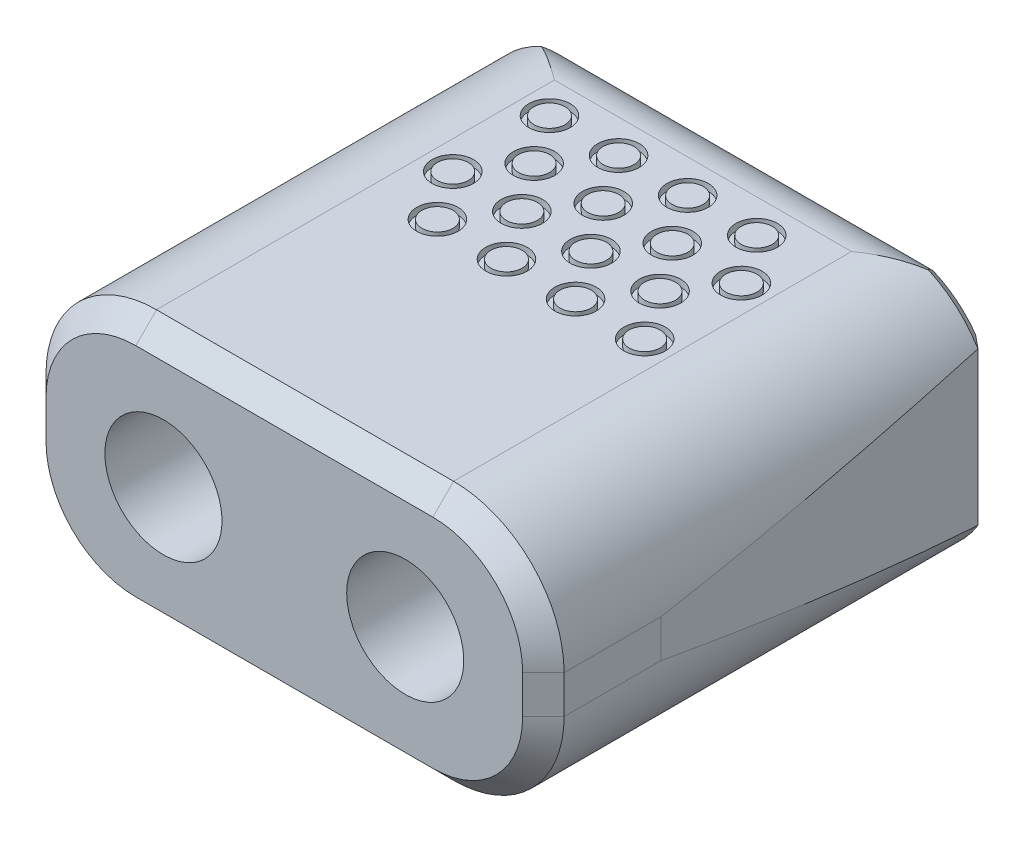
from build123d import *

# Parameters (mm, degrees)
SKETCH3_W             = 16.9672
SKETCH3_H             = 9.525
EXTRUDE1_DEPTH        = 19.05
F_6_CBORE_D           = 4.3053
F_6_CBORE_CBORE_D     = 6.604
F_6_CBORE_CBORE_DEPTH = 4.064
FILLET1_R             = 4.064
CHAMFER1_SIZE         = 0.396875
CHAMFER2_SIZE         = 0.762
CUT_EXTRUDE2_DEPTH    = 26.951296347
CUT_EXTRUDE1_DEPTH    = 12.5
CHAMFER3_SIZE         = 0.396875
CHAMFER3_SIZE2        = 0.443224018
SKETCH10_R            = 0.762
SKETCH10_R_2          = 0.5715
CUT_EXTRUDE3_DEPTH    = 0.254


with BuildPart() as part:
    # Sketch3 → Extrude1 (new body)
    with BuildSketch(Plane(origin=(0, 0, 0), x_dir=(0, 0, -1), z_dir=(1, 0, 0))):
        with Locations((8.4836, 0)):
            Rectangle(SKETCH3_W, SKETCH3_H)
    extrude(amount=EXTRUDE1_DEPTH)

    # 6 CBORE (through all)
    with Locations(Plane(origin=(0, 0, -16.9672), x_dir=(-1, 0, 0), z_dir=(0, 0, -1))):
        with Locations((-5.08, 0), (-13.97, 0)):
            CounterBoreHole(F_6_CBORE_D / 2, F_6_CBORE_CBORE_D / 2, F_6_CBORE_CBORE_DEPTH)

    # Fillet1
    fillet1_edges = [part.edges().sort_by_distance(p)[0] for p in [
        (19.05, 4.7625, -8.4836),
        (0, 4.7625, -8.4836),
        (0, -4.7625, -8.4836),
        (19.05, -4.7625, -8.4836),
    ]]
    fillet(fillet1_edges, radius=FILLET1_R)

    # Chamfer1
    chamfer1_edges = [part.edges().sort_by_distance(p)[0] for p in [
        (9.525, 4.7625, -16.9672),
        (0, 0, -16.9672),
        (19.05, 0, -16.9672),
        (9.525, -4.7625, -16.9672),
        (17.859681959, 3.572181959, -16.9672),
        (17.859681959, -3.572181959, -16.9672),
        (1.190318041, -3.572181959, -16.9672),
        (1.190318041, 3.572181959, -16.9672),
    ]]
    chamfer(chamfer1_edges, length=CHAMFER1_SIZE)

    # Chamfer2
    chamfer2_edges = [part.edges().sort_by_distance(p)[0] for p in [
        (9.525, 4.7625, 0),
        (0, 0, 0),
        (9.525, -4.7625, 0),
        (19.05, 0, 0),
        (17.859681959, 3.572181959, 0),
        (17.859681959, -3.572181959, 0),
        (1.190318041, -3.572181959, 0),
        (1.190318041, 3.572181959, 0),
    ]]
    chamfer(chamfer2_edges, length=CHAMFER2_SIZE)

    # Sketch8 → Cut-Extrude2 (cut, through all)
    with BuildSketch(Plane.ZY):
        with BuildLine():
            Line((-15.3924, -4.7625), (-15.3924, -7.3025))
            Line((-15.3924, -7.3025), (-21.7424, -7.3025))
            Line((-21.7424, -7.3025), (-21.7424, -0.9525))
            Line((-21.7424, -0.9525), (-19.2024, -0.9525))
            ThreePointArc((-19.2024, -0.9525), (-18.770316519, -2.714822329), (-17.572069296, -4.077422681))
            Line((-17.572069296, -4.077422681), (-16.9672, -4.077422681))
            ThreePointArc((-16.9672, -4.077422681), (-16.251080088, -4.583814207), (-15.3924, -4.7625))
        make_face()
        with BuildLine():
            Line((-16.9672, 4.077422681), (-17.572069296, 4.077422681))
            ThreePointArc((-17.572069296, 4.077422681), (-18.770316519, 2.714822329), (-19.2024, 0.9525))
            Line((-19.2024, 0.9525), (-21.7424, 0.9525))
            Line((-21.7424, 0.9525), (-21.7424, 7.3025))
            Line((-21.7424, 7.3025), (-15.3924, 7.3025))
            Line((-15.3924, 7.3025), (-15.3924, 4.7625))
            ThreePointArc((-15.3924, 4.7625), (-16.251080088, 4.583814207), (-16.9672, 4.077422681))
        make_face()
    extrude(amount=-CUT_EXTRUDE2_DEPTH, mode=Mode.SUBTRACT)

    # Sketch5 → Cut-Extrude1 (cut, symmetric)
    with BuildSketch(Plane(origin=(0, 0, 0), x_dir=(1, 0, 0), z_dir=(0, 1, 0))):
        with BuildLine():
            Line((19.05, 4.318), (31.75, 4.318))
            Line((31.75, 4.318), (31.75, 29.718))
            Line((31.75, 29.718), (16.484078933, 29.718))
            ThreePointArc((16.484078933, 29.718), (18.406891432, 17.082638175), (19.05, 4.318))
        make_face()
    cut_extrude1 = extrude(amount=CUT_EXTRUDE1_DEPTH, both=True, mode=Mode.SUBTRACT)

    # Mirror2: Cut-Extrude1 across plane
    add(cut_extrude1.mirror(Plane(origin=(9.525, 0, 0), x_dir=(0, 0, 1), z_dir=(1, 0, 0))), mode=Mode.SUBTRACT)

    # Chamfer3
    chamfer3_edges = [part.edges().sort_by_distance(p)[0] for p in [
        (18.418499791, 0, -16.9672),
    ]]
    chamfer3_side = [part.faces().sort_by_distance(p)[0] for p in [
        (18.892026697, 0, -10.650476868),
    ]]
    chamfer(chamfer3_edges, length=CHAMFER3_SIZE, length2=CHAMFER3_SIZE2, reference=chamfer3_side[0])

    # Sketch10 → Cut-Extrude3 (cut)
    # profile 1 of 16: a face of its own
    with BuildSketch(Plane.XZ.offset(4.7625)):
        with Locations(Location((5.107892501, -14.166339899, 0), (0, 0, 270))):
            Circle(SKETCH10_R)
        with Locations(Location((5.107892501, -14.166339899, 0), (0, 0, 270))):
            Circle(SKETCH10_R_2, mode=Mode.SUBTRACT)
    # profile 2 of 16: a face of its own
    with BuildSketch(Plane.XZ.offset(4.7625)):
        with Locations(Location((7.647892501, -14.166339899, 0), (0, 0, 270))):
            Circle(SKETCH10_R)
        with Locations(Location((7.647892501, -14.166339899, 0), (0, 0, 270))):
            Circle(SKETCH10_R_2, mode=Mode.SUBTRACT)
    # profile 3 of 16: a face of its own
    with BuildSketch(Plane.XZ.offset(4.7625)):
        with Locations(Location((10.187892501, -14.166339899, 0), (0, 0, 270))):
            Circle(SKETCH10_R)
        with Locations(Location((10.187892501, -14.166339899, 0), (0, 0, 270))):
            Circle(SKETCH10_R_2, mode=Mode.SUBTRACT)
    # profile 4 of 16: a face of its own
    with BuildSketch(Plane.XZ.offset(4.7625)):
        with Locations(Location((12.727892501, -14.166339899, 0), (0, 0, 270))):
            Circle(SKETCH10_R)
        with Locations(Location((12.727892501, -14.166339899, 0), (0, 0, 270))):
            Circle(SKETCH10_R_2, mode=Mode.SUBTRACT)
    # profile 5 of 16: a face of its own
    with BuildSketch(Plane.XZ.offset(4.7625)):
        with Locations(Location((6.3483131, -12.361174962, 0), (0, 0, 270))):
            Circle(SKETCH10_R)
        with Locations(Location((6.3483131, -12.361174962, 0), (0, 0, 270))):
            Circle(SKETCH10_R_2, mode=Mode.SUBTRACT)
    # profile 6 of 16: a face of its own
    with BuildSketch(Plane.XZ.offset(4.7625)):
        with Locations(Location((8.8883131, -12.361174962, 0), (0, 0, 270))):
            Circle(SKETCH10_R)
        with Locations(Location((8.8883131, -12.361174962, 0), (0, 0, 270))):
            Circle(SKETCH10_R_2, mode=Mode.SUBTRACT)
    # profile 7 of 16: a face of its own
    with BuildSketch(Plane.XZ.offset(4.7625)):
        with Locations(Location((11.4283131, -12.361174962, 0), (0, 0, 270))):
            Circle(SKETCH10_R)
        with Locations(Location((11.4283131, -12.361174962, 0), (0, 0, 270))):
            Circle(SKETCH10_R_2, mode=Mode.SUBTRACT)
    # profile 8 of 16: a face of its own
    with BuildSketch(Plane.XZ.offset(4.7625)):
        with Locations(Location((13.9683131, -12.361174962, 0), (0, 0, 270))):
            Circle(SKETCH10_R)
        with Locations(Location((13.9683131, -12.361174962, 0), (0, 0, 270))):
            Circle(SKETCH10_R_2, mode=Mode.SUBTRACT)
    # profile 9 of 16: a face of its own
    with BuildSketch(Plane.XZ.offset(4.7625)):
        with Locations(Location((5.107892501, -10.610339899, 0), (0, 0, 270))):
            Circle(SKETCH10_R)
        with Locations(Location((5.107892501, -10.610339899, 0), (0, 0, 270))):
            Circle(SKETCH10_R_2, mode=Mode.SUBTRACT)
    # profile 10 of 16: a face of its own
    with BuildSketch(Plane.XZ.offset(4.7625)):
        with Locations(Location((7.647892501, -10.610339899, 0), (0, 0, 270))):
            Circle(SKETCH10_R)
        with Locations(Location((7.647892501, -10.610339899, 0), (0, 0, 270))):
            Circle(SKETCH10_R_2, mode=Mode.SUBTRACT)
    # profile 11 of 16: a face of its own
    with BuildSketch(Plane.XZ.offset(4.7625)):
        with Locations(Location((10.187892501, -10.610339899, 0), (0, 0, 270))):
            Circle(SKETCH10_R)
        with Locations(Location((10.187892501, -10.610339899, 0), (0, 0, 270))):
            Circle(SKETCH10_R_2, mode=Mode.SUBTRACT)
    # profile 12 of 16: a face of its own
    with BuildSketch(Plane.XZ.offset(4.7625)):
        with Locations(Location((12.727892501, -10.610339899, 0), (0, 0, 270))):
            Circle(SKETCH10_R)
        with Locations(Location((12.727892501, -10.610339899, 0), (0, 0, 270))):
            Circle(SKETCH10_R_2, mode=Mode.SUBTRACT)
    # profile 13 of 16: a face of its own
    with BuildSketch(Plane.XZ.offset(4.7625)):
        with Locations(Location((6.3483131, -8.805174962, 0), (0, 0, 270))):
            Circle(SKETCH10_R)
        with Locations(Location((6.3483131, -8.805174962, 0), (0, 0, 270))):
            Circle(SKETCH10_R_2, mode=Mode.SUBTRACT)
    # profile 14 of 16: a face of its own
    with BuildSketch(Plane.XZ.offset(4.7625)):
        with Locations(Location((8.8883131, -8.805174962, 0), (0, 0, 270))):
            Circle(SKETCH10_R)
        with Locations(Location((8.8883131, -8.805174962, 0), (0, 0, 270))):
            Circle(SKETCH10_R_2, mode=Mode.SUBTRACT)
    # profile 15 of 16: a face of its own
    with BuildSketch(Plane.XZ.offset(4.7625)):
        with Locations(Location((11.4283131, -8.805174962, 0), (0, 0, 270))):
            Circle(SKETCH10_R)
        with Locations(Location((11.4283131, -8.805174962, 0), (0, 0, 270))):
            Circle(SKETCH10_R_2, mode=Mode.SUBTRACT)
    # profile 16 of 16: a face of its own
    with BuildSketch(Plane.XZ.offset(4.7625)):
        with Locations(Location((13.9683131, -8.805174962, 0), (0, 0, 270))):
            Circle(SKETCH10_R)
        with Locations(Location((13.9683131, -8.805174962, 0), (0, 0, 270))):
            Circle(SKETCH10_R_2, mode=Mode.SUBTRACT)
    cut_extrude3 = extrude(amount=-CUT_EXTRUDE3_DEPTH, mode=Mode.SUBTRACT)

    # Mirror1: Cut-Extrude3 across plane
    add(cut_extrude3.mirror(Plane.ZX), mode=Mode.SUBTRACT)


solid = part.part
